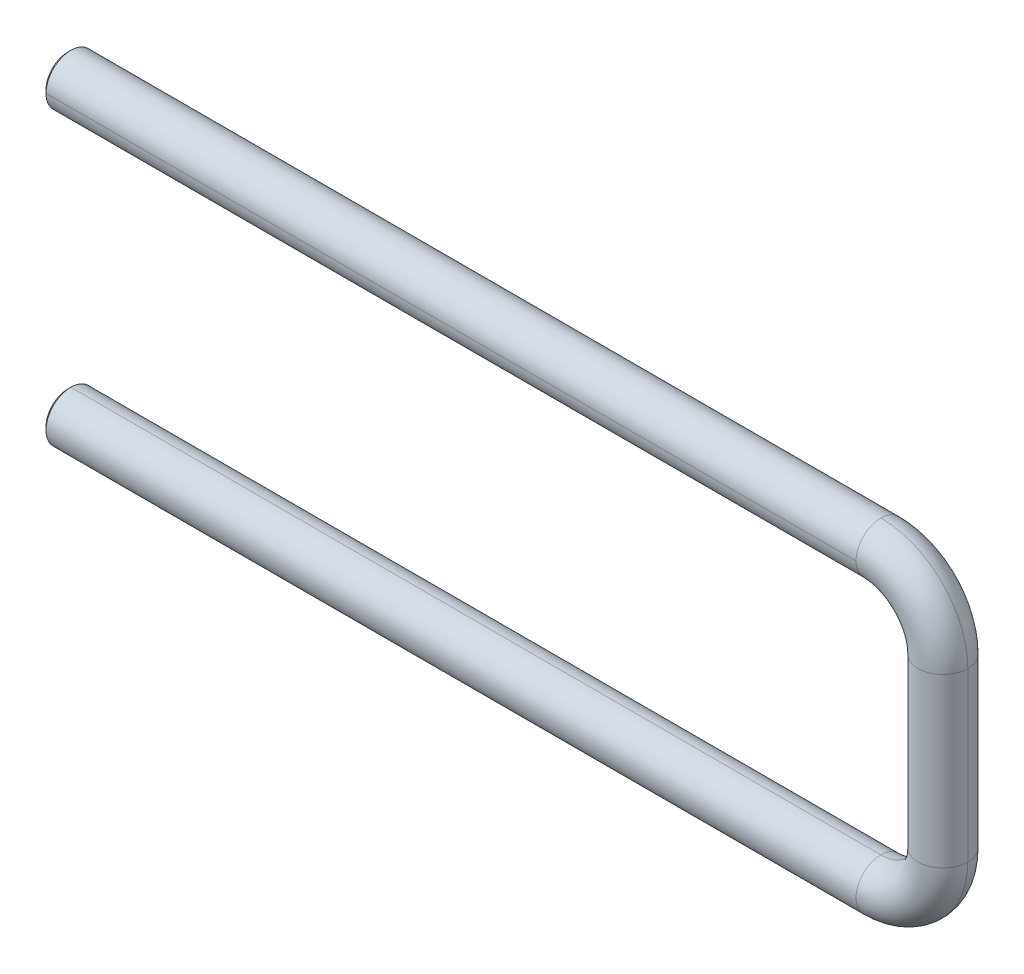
ISO-10303-21;
HEADER;
FILE_DESCRIPTION(('STEP AP214'),'2;1');
FILE_NAME('part.step','',(''),(''),'','','');
FILE_SCHEMA(('AUTOMOTIVE_DESIGN { 1 0 10303 214 1 1 1 1 }'));
ENDSEC;
DATA;
#1=APPLICATION_CONTEXT('core data for automotive mechanical design processes');
#2=APPLICATION_PROTOCOL_DEFINITION('international standard','automotive_design',2000,#1);
#3=PRODUCT_CONTEXT('',#1,'mechanical');
#4=PRODUCT('Part','Part','',(#3));
#5=PRODUCT_RELATED_PRODUCT_CATEGORY('part','',(#4));
#6=PRODUCT_DEFINITION_FORMATION('','',#4);
#7=PRODUCT_DEFINITION_CONTEXT('part definition',#1,'design');
#8=PRODUCT_DEFINITION('design','',#6,#7);
#9=PRODUCT_DEFINITION_SHAPE('','',#8);
#10=(LENGTH_UNIT() NAMED_UNIT(*) SI_UNIT(.MILLI.,.METRE.));
#11=(NAMED_UNIT(*) PLANE_ANGLE_UNIT() SI_UNIT($,.RADIAN.));
#12=(NAMED_UNIT(*) SI_UNIT($,.STERADIAN.) SOLID_ANGLE_UNIT());
#13=UNCERTAINTY_MEASURE_WITH_UNIT(LENGTH_MEASURE(1.E-05),#10,'distance_accuracy_value','');
#14=(GEOMETRIC_REPRESENTATION_CONTEXT(3) GLOBAL_UNCERTAINTY_ASSIGNED_CONTEXT((#13)) GLOBAL_UNIT_ASSIGNED_CONTEXT((#10,
#11,#12)) REPRESENTATION_CONTEXT('',''));
#15=CARTESIAN_POINT('',(0.,0.,0.));
#16=DIRECTION('',(0.,0.,1.));
#17=DIRECTION('',(1.,0.,0.));
#18=AXIS2_PLACEMENT_3D('',#15,#16,#17);
#19=CARTESIAN_POINT('',(-10.,13.5,0.));
#20=DIRECTION('',(0.,0.,-1.));
#21=DIRECTION('',(0.,1.,0.));
#22=AXIS2_PLACEMENT_3D('',#19,#20,#21);
#23=TOROIDAL_SURFACE('',#22,10.,4.);
#24=CARTESIAN_POINT('',(-10.,23.5,0.));
#25=DIRECTION('',(1.,0.,0.));
#26=DIRECTION('',(0.,0.,1.));
#27=AXIS2_PLACEMENT_3D('',#24,#25,#26);
#28=CIRCLE('',#27,4.);
#29=CARTESIAN_POINT('',(-10.,23.5,-4.));
#30=VERTEX_POINT('',#29);
#31=CARTESIAN_POINT('',(-10.,27.5,0.));
#32=VERTEX_POINT('',#31);
#33=EDGE_CURVE('E9',#30,#32,#28,.T.);
#34=ORIENTED_EDGE('',*,*,#33,.T.);
#35=CARTESIAN_POINT('',(-10.,13.5,0.));
#36=DIRECTION('',(0.,0.,-1.));
#37=DIRECTION('',(0.,1.,0.));
#38=AXIS2_PLACEMENT_3D('',#35,#36,#37);
#39=CIRCLE('',#38,14.);
#40=CARTESIAN_POINT('',(4.,13.5,0.));
#41=VERTEX_POINT('',#40);
#42=EDGE_CURVE('E25',#32,#41,#39,.T.);
#43=ORIENTED_EDGE('',*,*,#42,.T.);
#44=CARTESIAN_POINT('',(0.,13.5,0.));
#45=DIRECTION('',(0.,-1.,0.));
#46=DIRECTION('',(0.,0.,1.));
#47=AXIS2_PLACEMENT_3D('',#44,#45,#46);
#48=CIRCLE('',#47,4.);
#49=CARTESIAN_POINT('',(-4.,13.5,0.));
#50=VERTEX_POINT('',#49);
#51=EDGE_CURVE('E133',#50,#41,#48,.T.);
#52=ORIENTED_EDGE('',*,*,#51,.F.);
#53=CARTESIAN_POINT('',(-10.,13.5,0.));
#54=DIRECTION('',(0.,0.,-1.));
#55=DIRECTION('',(0.,1.,0.));
#56=AXIS2_PLACEMENT_3D('',#53,#54,#55);
#57=CIRCLE('',#56,6.);
#58=CARTESIAN_POINT('',(-10.,19.5,0.));
#59=VERTEX_POINT('',#58);
#60=EDGE_CURVE('E111',#59,#50,#57,.T.);
#61=ORIENTED_EDGE('',*,*,#60,.F.);
#62=CARTESIAN_POINT('',(-10.,23.5,0.));
#63=DIRECTION('',(1.,0.,0.));
#64=DIRECTION('',(0.,0.,1.));
#65=AXIS2_PLACEMENT_3D('',#62,#63,#64);
#66=CIRCLE('',#65,4.);
#67=EDGE_CURVE('E108',#59,#30,#66,.T.);
#68=ORIENTED_EDGE('',*,*,#67,.T.);
#69=EDGE_LOOP('',(#34,#43,#52,#61,#68));
#70=FACE_BOUND('',#69,.T.);
#71=ADVANCED_FACE('F14',(#70),#23,.T.);
#72=CARTESIAN_POINT('',(-10.,-13.5,0.));
#73=DIRECTION('',(0.,0.,-1.));
#74=DIRECTION('',(0.,1.,0.));
#75=AXIS2_PLACEMENT_3D('',#72,#73,#74);
#76=TOROIDAL_SURFACE('',#75,10.,4.);
#77=CARTESIAN_POINT('',(0.,-13.5,0.));
#78=DIRECTION('',(0.,-1.,0.));
#79=DIRECTION('',(0.,0.,1.));
#80=AXIS2_PLACEMENT_3D('',#77,#78,#79);
#81=CIRCLE('',#80,4.);
#82=CARTESIAN_POINT('',(-4.,-13.5,0.));
#83=VERTEX_POINT('',#82);
#84=CARTESIAN_POINT('',(4.,-13.5,0.));
#85=VERTEX_POINT('',#84);
#86=EDGE_CURVE('E145',#83,#85,#81,.T.);
#87=ORIENTED_EDGE('',*,*,#86,.T.);
#88=CARTESIAN_POINT('',(-10.,-13.5,0.));
#89=DIRECTION('',(0.,0.,-1.));
#90=DIRECTION('',(0.,1.,0.));
#91=AXIS2_PLACEMENT_3D('',#88,#89,#90);
#92=CIRCLE('',#91,14.);
#93=CARTESIAN_POINT('',(-10.,-27.5,0.));
#94=VERTEX_POINT('',#93);
#95=EDGE_CURVE('E153',#85,#94,#92,.T.);
#96=ORIENTED_EDGE('',*,*,#95,.T.);
#97=CARTESIAN_POINT('',(-10.,-23.5,0.));
#98=DIRECTION('',(-1.,0.,0.));
#99=DIRECTION('',(0.,0.,1.));
#100=AXIS2_PLACEMENT_3D('',#97,#98,#99);
#101=CIRCLE('',#100,4.);
#102=CARTESIAN_POINT('',(-10.,-19.5,0.));
#103=VERTEX_POINT('',#102);
#104=EDGE_CURVE('E235',#103,#94,#101,.T.);
#105=ORIENTED_EDGE('',*,*,#104,.F.);
#106=CARTESIAN_POINT('',(-10.,-13.5,0.));
#107=DIRECTION('',(0.,0.,-1.));
#108=DIRECTION('',(0.,1.,0.));
#109=AXIS2_PLACEMENT_3D('',#106,#107,#108);
#110=CIRCLE('',#109,6.);
#111=EDGE_CURVE('E152',#83,#103,#110,.T.);
#112=ORIENTED_EDGE('',*,*,#111,.F.);
#113=EDGE_LOOP('',(#87,#96,#105,#112));
#114=FACE_BOUND('',#113,.T.);
#115=ADVANCED_FACE('F16',(#114),#76,.T.);
#116=CARTESIAN_POINT('',(-140.5,23.5,0.));
#117=DIRECTION('',(1.,0.,0.));
#118=DIRECTION('',(0.,0.,1.));
#119=AXIS2_PLACEMENT_3D('',#116,#117,#118);
#120=CONICAL_SURFACE('',#119,4.,0.785398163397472);
#121=CARTESIAN_POINT('',(-141.,23.5,0.));
#122=DIRECTION('',(-1.,0.,0.));
#123=DIRECTION('',(0.,0.,1.));
#124=AXIS2_PLACEMENT_3D('',#121,#122,#123);
#125=CIRCLE('',#124,3.5);
#126=CARTESIAN_POINT('',(-141.,23.5,-3.5));
#127=VERTEX_POINT('',#126);
#128=CARTESIAN_POINT('',(-141.,23.5,3.5));
#129=VERTEX_POINT('',#128);
#130=EDGE_CURVE('E18',#127,#129,#125,.T.);
#131=ORIENTED_EDGE('',*,*,#130,.F.);
#132=DIRECTION('',(0.707106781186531,0.,-0.707106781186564));
#133=VECTOR('',#132,1.);
#134=CARTESIAN_POINT('',(-140.5,23.5,-4.));
#135=LINE('',#134,#133);
#136=CARTESIAN_POINT('',(-140.5,23.5,-4.));
#137=VERTEX_POINT('',#136);
#138=EDGE_CURVE('E149',#127,#137,#135,.T.);
#139=ORIENTED_EDGE('',*,*,#138,.T.);
#140=CARTESIAN_POINT('',(-140.5,23.5,0.));
#141=DIRECTION('',(1.,0.,0.));
#142=DIRECTION('',(0.,0.,1.));
#143=AXIS2_PLACEMENT_3D('',#140,#141,#142);
#144=CIRCLE('',#143,4.);
#145=CARTESIAN_POINT('',(-140.5,23.5,4.));
#146=VERTEX_POINT('',#145);
#147=EDGE_CURVE('E121',#146,#137,#144,.T.);
#148=ORIENTED_EDGE('',*,*,#147,.F.);
#149=DIRECTION('',(0.707106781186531,0.,0.707106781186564));
#150=VECTOR('',#149,1.);
#151=CARTESIAN_POINT('',(-140.5,23.5,4.));
#152=LINE('',#151,#150);
#153=EDGE_CURVE('E191',#129,#146,#152,.T.);
#154=ORIENTED_EDGE('',*,*,#153,.F.);
#155=EDGE_LOOP('',(#131,#139,#148,#154));
#156=FACE_BOUND('',#155,.T.);
#157=ADVANCED_FACE('F268',(#156),#120,.T.);
#158=CARTESIAN_POINT('',(-141.,-23.5,0.));
#159=DIRECTION('',(1.,0.,0.));
#160=DIRECTION('',(0.,0.,1.));
#161=AXIS2_PLACEMENT_3D('',#158,#159,#160);
#162=CONICAL_SURFACE('',#161,3.5,0.785398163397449);
#163=CARTESIAN_POINT('',(-141.,-23.5,0.));
#164=DIRECTION('',(-1.,0.,0.));
#165=DIRECTION('',(0.,-1.,0.));
#166=AXIS2_PLACEMENT_3D('',#163,#164,#165);
#167=CIRCLE('',#166,3.5);
#168=CARTESIAN_POINT('',(-141.,-23.5,-3.5));
#169=VERTEX_POINT('',#168);
#170=CARTESIAN_POINT('',(-141.,-23.5,3.5));
#171=VERTEX_POINT('',#170);
#172=EDGE_CURVE('E142',#169,#171,#167,.T.);
#173=ORIENTED_EDGE('',*,*,#172,.F.);
#174=DIRECTION('',(0.707106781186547,0.,-0.707106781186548));
#175=VECTOR('',#174,1.);
#176=CARTESIAN_POINT('',(-141.,-23.5,-3.5));
#177=LINE('',#176,#175);
#178=CARTESIAN_POINT('',(-140.5,-23.5,-4.));
#179=VERTEX_POINT('',#178);
#180=EDGE_CURVE('E120',#169,#179,#177,.T.);
#181=ORIENTED_EDGE('',*,*,#180,.T.);
#182=CARTESIAN_POINT('',(-140.5,-23.5,0.));
#183=DIRECTION('',(1.,0.,0.));
#184=DIRECTION('',(0.,0.,-1.));
#185=AXIS2_PLACEMENT_3D('',#182,#183,#184);
#186=CIRCLE('',#185,4.);
#187=CARTESIAN_POINT('',(-140.5,-27.5,0.));
#188=VERTEX_POINT('',#187);
#189=EDGE_CURVE('E182',#188,#179,#186,.T.);
#190=ORIENTED_EDGE('',*,*,#189,.F.);
#191=CARTESIAN_POINT('',(-140.5,-23.5,0.));
#192=DIRECTION('',(1.,0.,0.));
#193=DIRECTION('',(0.,0.,-1.));
#194=AXIS2_PLACEMENT_3D('',#191,#192,#193);
#195=CIRCLE('',#194,4.);
#196=CARTESIAN_POINT('',(-140.5,-23.5,4.));
#197=VERTEX_POINT('',#196);
#198=EDGE_CURVE('E137',#197,#188,#195,.T.);
#199=ORIENTED_EDGE('',*,*,#198,.F.);
#200=DIRECTION('',(0.707106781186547,0.,0.707106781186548));
#201=VECTOR('',#200,1.);
#202=CARTESIAN_POINT('',(-141.,-23.5,3.5));
#203=LINE('',#202,#201);
#204=EDGE_CURVE('E189',#171,#197,#203,.T.);
#205=ORIENTED_EDGE('',*,*,#204,.F.);
#206=EDGE_LOOP('',(#173,#181,#190,#199,#205));
#207=FACE_BOUND('',#206,.T.);
#208=ADVANCED_FACE('F281',(#207),#162,.T.);
#209=CARTESIAN_POINT('',(-10.,23.5,0.));
#210=DIRECTION('',(-1.,0.,0.));
#211=DIRECTION('',(0.,0.,-1.));
#212=AXIS2_PLACEMENT_3D('',#209,#210,#211);
#213=CYLINDRICAL_SURFACE('',#212,4.);
#214=CARTESIAN_POINT('',(-10.,23.5,0.));
#215=DIRECTION('',(1.,0.,0.));
#216=DIRECTION('',(0.,0.,1.));
#217=AXIS2_PLACEMENT_3D('',#214,#215,#216);
#218=CIRCLE('',#217,4.);
#219=CARTESIAN_POINT('',(-10.,23.5,4.));
#220=VERTEX_POINT('',#219);
#221=EDGE_CURVE('E100',#220,#59,#218,.T.);
#222=ORIENTED_EDGE('',*,*,#221,.F.);
#223=DIRECTION('',(-1.,0.,0.));
#224=VECTOR('',#223,1.);
#225=CARTESIAN_POINT('',(-10.,23.5,4.));
#226=LINE('',#225,#224);
#227=EDGE_CURVE('E104',#220,#146,#226,.T.);
#228=ORIENTED_EDGE('',*,*,#227,.T.);
#229=ORIENTED_EDGE('',*,*,#147,.T.);
#230=DIRECTION('',(-1.,0.,0.));
#231=VECTOR('',#230,1.);
#232=CARTESIAN_POINT('',(-10.,23.5,-4.));
#233=LINE('',#232,#231);
#234=EDGE_CURVE('E159',#30,#137,#233,.T.);
#235=ORIENTED_EDGE('',*,*,#234,.F.);
#236=ORIENTED_EDGE('',*,*,#67,.F.);
#237=EDGE_LOOP('',(#222,#228,#229,#235,#236));
#238=FACE_BOUND('',#237,.T.);
#239=ADVANCED_FACE('F102',(#238),#213,.T.);
#240=CARTESIAN_POINT('',(0.,13.5,0.));
#241=DIRECTION('',(0.,-1.,0.));
#242=DIRECTION('',(1.,0.,0.));
#243=AXIS2_PLACEMENT_3D('',#240,#241,#242);
#244=CYLINDRICAL_SURFACE('',#243,4.);
#245=CARTESIAN_POINT('',(0.,13.5,0.));
#246=DIRECTION('',(0.,-1.,0.));
#247=DIRECTION('',(0.,0.,1.));
#248=AXIS2_PLACEMENT_3D('',#245,#246,#247);
#249=CIRCLE('',#248,4.);
#250=EDGE_CURVE('E164',#41,#50,#249,.T.);
#251=ORIENTED_EDGE('',*,*,#250,.T.);
#252=DIRECTION('',(0.,-1.,0.));
#253=VECTOR('',#252,1.);
#254=CARTESIAN_POINT('',(-4.,13.5,0.));
#255=LINE('',#254,#253);
#256=EDGE_CURVE('E160',#50,#83,#255,.T.);
#257=ORIENTED_EDGE('',*,*,#256,.T.);
#258=CARTESIAN_POINT('',(0.,-13.5,0.));
#259=DIRECTION('',(0.,-1.,0.));
#260=DIRECTION('',(0.,0.,1.));
#261=AXIS2_PLACEMENT_3D('',#258,#259,#260);
#262=CIRCLE('',#261,4.);
#263=EDGE_CURVE('E166',#85,#83,#262,.T.);
#264=ORIENTED_EDGE('',*,*,#263,.F.);
#265=DIRECTION('',(0.,-1.,0.));
#266=VECTOR('',#265,1.);
#267=CARTESIAN_POINT('',(4.,13.5,0.));
#268=LINE('',#267,#266);
#269=EDGE_CURVE('E125',#41,#85,#268,.T.);
#270=ORIENTED_EDGE('',*,*,#269,.F.);
#271=EDGE_LOOP('',(#251,#257,#264,#270));
#272=FACE_BOUND('',#271,.T.);
#273=ADVANCED_FACE('F222',(#272),#244,.T.);
#274=CARTESIAN_POINT('',(-10.,-23.5,0.));
#275=DIRECTION('',(-1.,0.,0.));
#276=DIRECTION('',(0.,-1.,0.));
#277=AXIS2_PLACEMENT_3D('',#274,#275,#276);
#278=CYLINDRICAL_SURFACE('',#277,4.);
#279=CARTESIAN_POINT('',(-10.,-23.5,0.));
#280=DIRECTION('',(-1.,0.,0.));
#281=DIRECTION('',(0.,0.,1.));
#282=AXIS2_PLACEMENT_3D('',#279,#280,#281);
#283=CIRCLE('',#282,4.);
#284=EDGE_CURVE('E165',#94,#103,#283,.T.);
#285=ORIENTED_EDGE('',*,*,#284,.T.);
#286=DIRECTION('',(-1.,0.,0.));
#287=VECTOR('',#286,1.);
#288=CARTESIAN_POINT('',(-10.,-19.5,0.));
#289=LINE('',#288,#287);
#290=CARTESIAN_POINT('',(-140.5,-19.5,0.));
#291=VERTEX_POINT('',#290);
#292=EDGE_CURVE('E171',#103,#291,#289,.T.);
#293=ORIENTED_EDGE('',*,*,#292,.T.);
#294=CARTESIAN_POINT('',(-140.5,-23.5,0.));
#295=DIRECTION('',(1.,0.,0.));
#296=DIRECTION('',(0.,0.,-1.));
#297=AXIS2_PLACEMENT_3D('',#294,#295,#296);
#298=CIRCLE('',#297,4.);
#299=EDGE_CURVE('E175',#291,#197,#298,.T.);
#300=ORIENTED_EDGE('',*,*,#299,.T.);
#301=ORIENTED_EDGE('',*,*,#198,.T.);
#302=DIRECTION('',(-1.,0.,0.));
#303=VECTOR('',#302,1.);
#304=CARTESIAN_POINT('',(-10.,-27.5,0.));
#305=LINE('',#304,#303);
#306=EDGE_CURVE('E202',#94,#188,#305,.T.);
#307=ORIENTED_EDGE('',*,*,#306,.F.);
#308=EDGE_LOOP('',(#285,#293,#300,#301,#307));
#309=FACE_BOUND('',#308,.T.);
#310=ADVANCED_FACE('F241',(#309),#278,.T.);
#311=CARTESIAN_POINT('',(-10.,-23.5,0.));
#312=DIRECTION('',(-1.,0.,0.));
#313=DIRECTION('',(0.,-1.,0.));
#314=AXIS2_PLACEMENT_3D('',#311,#312,#313);
#315=CYLINDRICAL_SURFACE('',#314,4.);
#316=ORIENTED_EDGE('',*,*,#292,.F.);
#317=ORIENTED_EDGE('',*,*,#104,.T.);
#318=ORIENTED_EDGE('',*,*,#306,.T.);
#319=ORIENTED_EDGE('',*,*,#189,.T.);
#320=CARTESIAN_POINT('',(-140.5,-23.5,0.));
#321=DIRECTION('',(1.,0.,0.));
#322=DIRECTION('',(0.,0.,-1.));
#323=AXIS2_PLACEMENT_3D('',#320,#321,#322);
#324=CIRCLE('',#323,4.);
#325=EDGE_CURVE('E170',#179,#291,#324,.T.);
#326=ORIENTED_EDGE('',*,*,#325,.T.);
#327=EDGE_LOOP('',(#316,#317,#318,#319,#326));
#328=FACE_BOUND('',#327,.T.);
#329=ADVANCED_FACE('F293',(#328),#315,.T.);
#330=CARTESIAN_POINT('',(-10.,-13.5,0.));
#331=DIRECTION('',(0.,0.,-1.));
#332=DIRECTION('',(0.,1.,0.));
#333=AXIS2_PLACEMENT_3D('',#330,#331,#332);
#334=TOROIDAL_SURFACE('',#333,10.,4.);
#335=ORIENTED_EDGE('',*,*,#95,.F.);
#336=ORIENTED_EDGE('',*,*,#263,.T.);
#337=ORIENTED_EDGE('',*,*,#111,.T.);
#338=ORIENTED_EDGE('',*,*,#284,.F.);
#339=EDGE_LOOP('',(#335,#336,#337,#338));
#340=FACE_BOUND('',#339,.T.);
#341=ADVANCED_FACE('F230',(#340),#334,.T.);
#342=CARTESIAN_POINT('',(0.,13.5,0.));
#343=DIRECTION('',(0.,-1.,0.));
#344=DIRECTION('',(1.,0.,0.));
#345=AXIS2_PLACEMENT_3D('',#342,#343,#344);
#346=CYLINDRICAL_SURFACE('',#345,4.);
#347=ORIENTED_EDGE('',*,*,#256,.F.);
#348=ORIENTED_EDGE('',*,*,#51,.T.);
#349=ORIENTED_EDGE('',*,*,#269,.T.);
#350=ORIENTED_EDGE('',*,*,#86,.F.);
#351=EDGE_LOOP('',(#347,#348,#349,#350));
#352=FACE_BOUND('',#351,.T.);
#353=ADVANCED_FACE('F225',(#352),#346,.T.);
#354=CARTESIAN_POINT('',(-10.,13.5,0.));
#355=DIRECTION('',(0.,0.,-1.));
#356=DIRECTION('',(0.,1.,0.));
#357=AXIS2_PLACEMENT_3D('',#354,#355,#356);
#358=TOROIDAL_SURFACE('',#357,10.,4.);
#359=ORIENTED_EDGE('',*,*,#42,.F.);
#360=CARTESIAN_POINT('',(-10.,23.5,0.));
#361=DIRECTION('',(1.,0.,0.));
#362=DIRECTION('',(0.,0.,1.));
#363=AXIS2_PLACEMENT_3D('',#360,#361,#362);
#364=CIRCLE('',#363,4.);
#365=EDGE_CURVE('E110',#32,#220,#364,.T.);
#366=ORIENTED_EDGE('',*,*,#365,.T.);
#367=ORIENTED_EDGE('',*,*,#221,.T.);
#368=ORIENTED_EDGE('',*,*,#60,.T.);
#369=ORIENTED_EDGE('',*,*,#250,.F.);
#370=EDGE_LOOP('',(#359,#366,#367,#368,#369));
#371=FACE_BOUND('',#370,.T.);
#372=ADVANCED_FACE('F123',(#371),#358,.T.);
#373=CARTESIAN_POINT('',(-10.,23.5,0.));
#374=DIRECTION('',(-1.,0.,0.));
#375=DIRECTION('',(0.,0.,-1.));
#376=AXIS2_PLACEMENT_3D('',#373,#374,#375);
#377=CYLINDRICAL_SURFACE('',#376,4.);
#378=ORIENTED_EDGE('',*,*,#227,.F.);
#379=ORIENTED_EDGE('',*,*,#365,.F.);
#380=ORIENTED_EDGE('',*,*,#33,.F.);
#381=ORIENTED_EDGE('',*,*,#234,.T.);
#382=CARTESIAN_POINT('',(-140.5,23.5,0.));
#383=DIRECTION('',(1.,0.,0.));
#384=DIRECTION('',(0.,0.,1.));
#385=AXIS2_PLACEMENT_3D('',#382,#383,#384);
#386=CIRCLE('',#385,4.);
#387=EDGE_CURVE('E118',#137,#146,#386,.T.);
#388=ORIENTED_EDGE('',*,*,#387,.T.);
#389=EDGE_LOOP('',(#378,#379,#380,#381,#388));
#390=FACE_BOUND('',#389,.T.);
#391=ADVANCED_FACE('F115',(#390),#377,.T.);
#392=CARTESIAN_POINT('',(-141.,-23.5,0.));
#393=DIRECTION('',(-1.,0.,0.));
#394=DIRECTION('',(0.,0.,-1.));
#395=AXIS2_PLACEMENT_3D('',#392,#393,#394);
#396=PLANE('',#395);
#397=CARTESIAN_POINT('',(-141.,-23.5,0.));
#398=DIRECTION('',(-1.,0.,0.));
#399=DIRECTION('',(0.,-1.,0.));
#400=AXIS2_PLACEMENT_3D('',#397,#398,#399);
#401=CIRCLE('',#400,3.5);
#402=EDGE_CURVE('E185',#171,#169,#401,.T.);
#403=ORIENTED_EDGE('',*,*,#402,.T.);
#404=ORIENTED_EDGE('',*,*,#172,.T.);
#405=EDGE_LOOP('',(#403,#404));
#406=FACE_BOUND('',#405,.T.);
#407=ADVANCED_FACE('F300',(#406),#396,.T.);
#408=CARTESIAN_POINT('',(-141.,23.5,0.));
#409=DIRECTION('',(1.,0.,0.));
#410=DIRECTION('',(0.,-1.,0.));
#411=AXIS2_PLACEMENT_3D('',#408,#409,#410);
#412=PLANE('',#411);
#413=CARTESIAN_POINT('',(-141.,23.5,0.));
#414=DIRECTION('',(-1.,0.,0.));
#415=DIRECTION('',(0.,0.,1.));
#416=AXIS2_PLACEMENT_3D('',#413,#414,#415);
#417=CIRCLE('',#416,3.5);
#418=EDGE_CURVE('E139',#129,#127,#417,.T.);
#419=ORIENTED_EDGE('',*,*,#418,.T.);
#420=ORIENTED_EDGE('',*,*,#130,.T.);
#421=EDGE_LOOP('',(#419,#420));
#422=FACE_BOUND('',#421,.T.);
#423=ADVANCED_FACE('F288',(#422),#412,.F.);
#424=CARTESIAN_POINT('',(-141.,-23.5,0.));
#425=DIRECTION('',(1.,0.,0.));
#426=DIRECTION('',(0.,0.,1.));
#427=AXIS2_PLACEMENT_3D('',#424,#425,#426);
#428=CONICAL_SURFACE('',#427,3.5,0.785398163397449);
#429=ORIENTED_EDGE('',*,*,#180,.F.);
#430=ORIENTED_EDGE('',*,*,#402,.F.);
#431=ORIENTED_EDGE('',*,*,#204,.T.);
#432=ORIENTED_EDGE('',*,*,#299,.F.);
#433=ORIENTED_EDGE('',*,*,#325,.F.);
#434=EDGE_LOOP('',(#429,#430,#431,#432,#433));
#435=FACE_BOUND('',#434,.T.);
#436=ADVANCED_FACE('F285',(#435),#428,.T.);
#437=CARTESIAN_POINT('',(-140.5,23.5,0.));
#438=DIRECTION('',(1.,0.,0.));
#439=DIRECTION('',(0.,0.,1.));
#440=AXIS2_PLACEMENT_3D('',#437,#438,#439);
#441=CONICAL_SURFACE('',#440,4.,0.785398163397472);
#442=ORIENTED_EDGE('',*,*,#138,.F.);
#443=ORIENTED_EDGE('',*,*,#418,.F.);
#444=ORIENTED_EDGE('',*,*,#153,.T.);
#445=ORIENTED_EDGE('',*,*,#387,.F.);
#446=EDGE_LOOP('',(#442,#443,#444,#445));
#447=FACE_BOUND('',#446,.T.);
#448=ADVANCED_FACE('F263',(#447),#441,.T.);
#449=CLOSED_SHELL('',(#71,#115,#157,#208,#239,#273,#310,#329,#341,#353,#372,#391,#407,#423,#436,#448));
#450=MANIFOLD_SOLID_BREP('B1',#449);
#451=ADVANCED_BREP_SHAPE_REPRESENTATION('',(#18,#450),#14);
#452=SHAPE_DEFINITION_REPRESENTATION(#9,#451);
ENDSEC;
END-ISO-10303-21;
